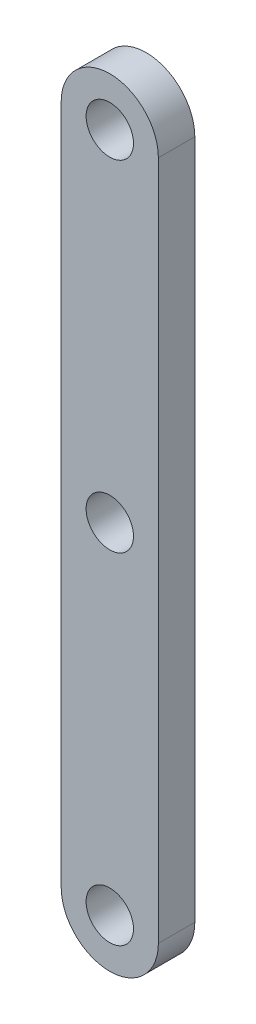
from build123d import *

# Parameters (mm, degrees)
EXTRUDE_1_DEPTH         = 3
HOLE_WIZARD_3_9_3_9_1_D = 3.9
HOLE_WIZARD_3_9_3_9_2_D = 3.9


with BuildPart() as part:
    # Sketch 1 → Extrude 1 (new body)
    with BuildSketch(Plane.XY):
        with BuildLine():
            Line((-4, 0), (-4, 56))
            ThreePointArc((-4, 56), (0, 60), (4, 56))
            Line((4, 56), (4, 0))
            ThreePointArc((4, 0), (0, -4), (-4, 0))
        make_face()
    extrude(amount=EXTRUDE_1_DEPTH)

    # Hole Wizard 3.9 _3.9_ _1 (through all)
    with Locations(Plane.XY.offset(3)):
        with Locations((0, 56), (0, 0)):
            Hole(HOLE_WIZARD_3_9_3_9_1_D / 2)

    # Hole Wizard 3.9 _3.9_ _2 (through all)
    with Locations(Plane.XY.offset(3)):
        with Locations((0, 28)):
            Hole(HOLE_WIZARD_3_9_3_9_2_D / 2)


solid = part.part
